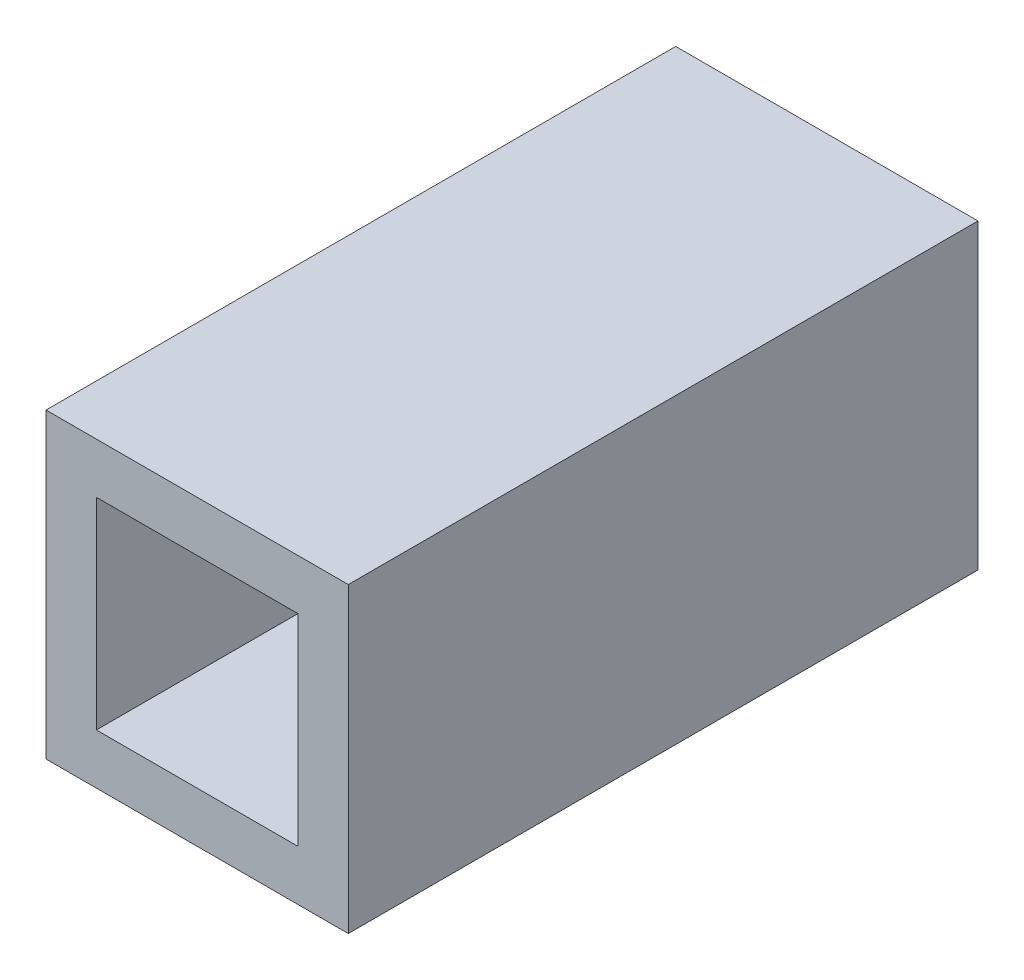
ISO-10303-21;
HEADER;
FILE_DESCRIPTION(('STEP AP214'),'2;1');
FILE_NAME('part.step','',(''),(''),'','','');
FILE_SCHEMA(('AUTOMOTIVE_DESIGN { 1 0 10303 214 1 1 1 1 }'));
ENDSEC;
DATA;
#1=APPLICATION_CONTEXT('core data for automotive mechanical design processes');
#2=APPLICATION_PROTOCOL_DEFINITION('international standard','automotive_design',2000,#1);
#3=PRODUCT_CONTEXT('',#1,'mechanical');
#4=PRODUCT('Part','Part','',(#3));
#5=PRODUCT_RELATED_PRODUCT_CATEGORY('part','',(#4));
#6=PRODUCT_DEFINITION_FORMATION('','',#4);
#7=PRODUCT_DEFINITION_CONTEXT('part definition',#1,'design');
#8=PRODUCT_DEFINITION('design','',#6,#7);
#9=PRODUCT_DEFINITION_SHAPE('','',#8);
#10=(LENGTH_UNIT() NAMED_UNIT(*) SI_UNIT(.MILLI.,.METRE.));
#11=(NAMED_UNIT(*) PLANE_ANGLE_UNIT() SI_UNIT($,.RADIAN.));
#12=(NAMED_UNIT(*) SI_UNIT($,.STERADIAN.) SOLID_ANGLE_UNIT());
#13=UNCERTAINTY_MEASURE_WITH_UNIT(LENGTH_MEASURE(1.E-05),#10,'distance_accuracy_value','');
#14=(GEOMETRIC_REPRESENTATION_CONTEXT(3) GLOBAL_UNCERTAINTY_ASSIGNED_CONTEXT((#13)) GLOBAL_UNIT_ASSIGNED_CONTEXT((#10,
#11,#12)) REPRESENTATION_CONTEXT('',''));
#15=CARTESIAN_POINT('',(0.,0.,0.));
#16=DIRECTION('',(0.,0.,1.));
#17=DIRECTION('',(1.,0.,0.));
#18=AXIS2_PLACEMENT_3D('',#15,#16,#17);
#19=CARTESIAN_POINT('',(-60.,60.,125.));
#20=DIRECTION('',(1.,0.,0.));
#21=DIRECTION('',(0.,1.,0.));
#22=AXIS2_PLACEMENT_3D('',#19,#20,#21);
#23=PLANE('',#22);
#24=DIRECTION('',(0.,0.,1.));
#25=VECTOR('',#24,1.);
#26=CARTESIAN_POINT('',(-60.,-10.,20.));
#27=LINE('',#26,#25);
#28=CARTESIAN_POINT('',(-60.,-10.,-20.));
#29=VERTEX_POINT('',#28);
#30=CARTESIAN_POINT('',(-60.,-10.,20.));
#31=VERTEX_POINT('',#30);
#32=EDGE_CURVE('E150',#29,#31,#27,.T.);
#33=ORIENTED_EDGE('',*,*,#32,.F.);
#34=DIRECTION('',(0.,-1.,0.));
#35=VECTOR('',#34,1.);
#36=CARTESIAN_POINT('',(-60.,9.99999999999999,-20.));
#37=LINE('',#36,#35);
#38=CARTESIAN_POINT('',(-60.,9.99999999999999,-20.));
#39=VERTEX_POINT('',#38);
#40=EDGE_CURVE('E47',#39,#29,#37,.T.);
#41=ORIENTED_EDGE('',*,*,#40,.F.);
#42=DIRECTION('',(0.,0.,-1.));
#43=VECTOR('',#42,1.);
#44=CARTESIAN_POINT('',(-60.,9.99999999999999,20.));
#45=LINE('',#44,#43);
#46=CARTESIAN_POINT('',(-60.,9.99999999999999,20.));
#47=VERTEX_POINT('',#46);
#48=EDGE_CURVE('E141',#47,#39,#45,.T.);
#49=ORIENTED_EDGE('',*,*,#48,.F.);
#50=DIRECTION('',(0.,1.,0.));
#51=VECTOR('',#50,1.);
#52=CARTESIAN_POINT('',(-60.,9.99999999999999,20.));
#53=LINE('',#52,#51);
#54=EDGE_CURVE('E144',#31,#47,#53,.T.);
#55=ORIENTED_EDGE('',*,*,#54,.F.);
#56=EDGE_LOOP('',(#33,#41,#49,#55));
#57=FACE_BOUND('',#56,.T.);
#58=DIRECTION('',(0.,-1.,0.));
#59=VECTOR('',#58,1.);
#60=CARTESIAN_POINT('',(-60.,60.,-125.));
#61=LINE('',#60,#59);
#62=CARTESIAN_POINT('',(-60.,60.,-125.));
#63=VERTEX_POINT('',#62);
#64=CARTESIAN_POINT('',(-60.,-60.,-125.));
#65=VERTEX_POINT('',#64);
#66=EDGE_CURVE('E183',#63,#65,#61,.T.);
#67=ORIENTED_EDGE('',*,*,#66,.T.);
#68=DIRECTION('',(0.,0.,-1.));
#69=VECTOR('',#68,1.);
#70=CARTESIAN_POINT('',(-60.,-60.,125.));
#71=LINE('',#70,#69);
#72=CARTESIAN_POINT('',(-60.,-60.,125.));
#73=VERTEX_POINT('',#72);
#74=EDGE_CURVE('E11',#73,#65,#71,.T.);
#75=ORIENTED_EDGE('',*,*,#74,.F.);
#76=DIRECTION('',(0.,-1.,0.));
#77=VECTOR('',#76,1.);
#78=CARTESIAN_POINT('',(-60.,60.,125.));
#79=LINE('',#78,#77);
#80=CARTESIAN_POINT('',(-60.,60.,125.));
#81=VERTEX_POINT('',#80);
#82=EDGE_CURVE('E190',#81,#73,#79,.T.);
#83=ORIENTED_EDGE('',*,*,#82,.F.);
#84=DIRECTION('',(0.,0.,-1.));
#85=VECTOR('',#84,1.);
#86=CARTESIAN_POINT('',(-60.,60.,125.));
#87=LINE('',#86,#85);
#88=EDGE_CURVE('E200',#81,#63,#87,.T.);
#89=ORIENTED_EDGE('',*,*,#88,.T.);
#90=EDGE_LOOP('',(#67,#75,#83,#89));
#91=FACE_BOUND('',#90,.T.);
#92=ADVANCED_FACE('F33',(#57,#91),#23,.F.);
#93=CARTESIAN_POINT('',(60.,-60.,125.));
#94=DIRECTION('',(0.,1.,0.));
#95=DIRECTION('',(-1.,0.,0.));
#96=AXIS2_PLACEMENT_3D('',#93,#94,#95);
#97=PLANE('',#96);
#98=DIRECTION('',(1.,0.,0.));
#99=VECTOR('',#98,1.);
#100=CARTESIAN_POINT('',(60.,-60.,-125.));
#101=LINE('',#100,#99);
#102=CARTESIAN_POINT('',(60.,-60.,-125.));
#103=VERTEX_POINT('',#102);
#104=EDGE_CURVE('E203',#65,#103,#101,.T.);
#105=ORIENTED_EDGE('',*,*,#104,.T.);
#106=DIRECTION('',(0.,0.,-1.));
#107=VECTOR('',#106,1.);
#108=CARTESIAN_POINT('',(60.,-60.,125.));
#109=LINE('',#108,#107);
#110=CARTESIAN_POINT('',(60.,-60.,125.));
#111=VERTEX_POINT('',#110);
#112=EDGE_CURVE('E40',#111,#103,#109,.T.);
#113=ORIENTED_EDGE('',*,*,#112,.F.);
#114=DIRECTION('',(1.,0.,0.));
#115=VECTOR('',#114,1.);
#116=CARTESIAN_POINT('',(60.,-60.,125.));
#117=LINE('',#116,#115);
#118=EDGE_CURVE('E193',#73,#111,#117,.T.);
#119=ORIENTED_EDGE('',*,*,#118,.F.);
#120=ORIENTED_EDGE('',*,*,#74,.T.);
#121=EDGE_LOOP('',(#105,#113,#119,#120));
#122=FACE_BOUND('',#121,.T.);
#123=ADVANCED_FACE('F233',(#122),#97,.F.);
#124=CARTESIAN_POINT('',(60.,60.,125.));
#125=DIRECTION('',(-1.,0.,0.));
#126=DIRECTION('',(0.,-1.,0.));
#127=AXIS2_PLACEMENT_3D('',#124,#125,#126);
#128=PLANE('',#127);
#129=DIRECTION('',(0.,1.,0.));
#130=VECTOR('',#129,1.);
#131=CARTESIAN_POINT('',(60.,60.,-125.));
#132=LINE('',#131,#130);
#133=CARTESIAN_POINT('',(60.,60.,-125.));
#134=VERTEX_POINT('',#133);
#135=EDGE_CURVE('E205',#103,#134,#132,.T.);
#136=ORIENTED_EDGE('',*,*,#135,.T.);
#137=DIRECTION('',(0.,0.,-1.));
#138=VECTOR('',#137,1.);
#139=CARTESIAN_POINT('',(60.,60.,125.));
#140=LINE('',#139,#138);
#141=CARTESIAN_POINT('',(60.,60.,125.));
#142=VERTEX_POINT('',#141);
#143=EDGE_CURVE('E210',#142,#134,#140,.T.);
#144=ORIENTED_EDGE('',*,*,#143,.F.);
#145=DIRECTION('',(0.,1.,0.));
#146=VECTOR('',#145,1.);
#147=CARTESIAN_POINT('',(60.,60.,125.));
#148=LINE('',#147,#146);
#149=EDGE_CURVE('E196',#111,#142,#148,.T.);
#150=ORIENTED_EDGE('',*,*,#149,.F.);
#151=ORIENTED_EDGE('',*,*,#112,.T.);
#152=EDGE_LOOP('',(#136,#144,#150,#151));
#153=FACE_BOUND('',#152,.T.);
#154=ADVANCED_FACE('F217',(#153),#128,.F.);
#155=CARTESIAN_POINT('',(60.,60.,125.));
#156=DIRECTION('',(0.,-1.,0.));
#157=DIRECTION('',(1.,0.,0.));
#158=AXIS2_PLACEMENT_3D('',#155,#156,#157);
#159=PLANE('',#158);
#160=DIRECTION('',(-1.,0.,0.));
#161=VECTOR('',#160,1.);
#162=CARTESIAN_POINT('',(60.,60.,-125.));
#163=LINE('',#162,#161);
#164=EDGE_CURVE('E194',#134,#63,#163,.T.);
#165=ORIENTED_EDGE('',*,*,#164,.T.);
#166=ORIENTED_EDGE('',*,*,#88,.F.);
#167=DIRECTION('',(-1.,0.,0.));
#168=VECTOR('',#167,1.);
#169=CARTESIAN_POINT('',(60.,60.,125.));
#170=LINE('',#169,#168);
#171=EDGE_CURVE('E198',#142,#81,#170,.T.);
#172=ORIENTED_EDGE('',*,*,#171,.F.);
#173=ORIENTED_EDGE('',*,*,#143,.T.);
#174=EDGE_LOOP('',(#165,#166,#172,#173));
#175=FACE_BOUND('',#174,.T.);
#176=ADVANCED_FACE('F226',(#175),#159,.F.);
#177=CARTESIAN_POINT('',(0.,0.,125.));
#178=DIRECTION('',(0.,0.,-1.));
#179=DIRECTION('',(-1.,0.,0.));
#180=AXIS2_PLACEMENT_3D('',#177,#178,#179);
#181=PLANE('',#180);
#182=DIRECTION('',(0.,-1.,0.));
#183=VECTOR('',#182,1.);
#184=CARTESIAN_POINT('',(40.,40.,125.));
#185=LINE('',#184,#183);
#186=CARTESIAN_POINT('',(40.,40.,125.));
#187=VERTEX_POINT('',#186);
#188=CARTESIAN_POINT('',(40.,-40.,125.));
#189=VERTEX_POINT('',#188);
#190=EDGE_CURVE('E168',#187,#189,#185,.T.);
#191=ORIENTED_EDGE('',*,*,#190,.T.);
#192=DIRECTION('',(-1.,0.,0.));
#193=VECTOR('',#192,1.);
#194=CARTESIAN_POINT('',(40.,-40.,125.));
#195=LINE('',#194,#193);
#196=CARTESIAN_POINT('',(-40.,-40.,125.));
#197=VERTEX_POINT('',#196);
#198=EDGE_CURVE('E160',#189,#197,#195,.T.);
#199=ORIENTED_EDGE('',*,*,#198,.T.);
#200=DIRECTION('',(0.,1.,0.));
#201=VECTOR('',#200,1.);
#202=CARTESIAN_POINT('',(-40.,-40.,125.));
#203=LINE('',#202,#201);
#204=CARTESIAN_POINT('',(-40.,40.,125.));
#205=VERTEX_POINT('',#204);
#206=EDGE_CURVE('E163',#197,#205,#203,.T.);
#207=ORIENTED_EDGE('',*,*,#206,.T.);
#208=DIRECTION('',(1.,0.,0.));
#209=VECTOR('',#208,1.);
#210=CARTESIAN_POINT('',(-40.,40.,125.));
#211=LINE('',#210,#209);
#212=EDGE_CURVE('E55',#205,#187,#211,.T.);
#213=ORIENTED_EDGE('',*,*,#212,.T.);
#214=EDGE_LOOP('',(#191,#199,#207,#213));
#215=FACE_BOUND('',#214,.T.);
#216=ORIENTED_EDGE('',*,*,#82,.T.);
#217=ORIENTED_EDGE('',*,*,#118,.T.);
#218=ORIENTED_EDGE('',*,*,#149,.T.);
#219=ORIENTED_EDGE('',*,*,#171,.T.);
#220=EDGE_LOOP('',(#216,#217,#218,#219));
#221=FACE_BOUND('',#220,.T.);
#222=ADVANCED_FACE('F232',(#215,#221),#181,.F.);
#223=CARTESIAN_POINT('',(0.,0.,-125.));
#224=DIRECTION('',(0.,0.,-1.));
#225=DIRECTION('',(-1.,0.,0.));
#226=AXIS2_PLACEMENT_3D('',#223,#224,#225);
#227=PLANE('',#226);
#228=DIRECTION('',(-1.,0.,0.));
#229=VECTOR('',#228,1.);
#230=CARTESIAN_POINT('',(40.,-40.,-125.));
#231=LINE('',#230,#229);
#232=CARTESIAN_POINT('',(40.,-40.,-125.));
#233=VERTEX_POINT('',#232);
#234=CARTESIAN_POINT('',(-40.,-40.,-125.));
#235=VERTEX_POINT('',#234);
#236=EDGE_CURVE('E156',#233,#235,#231,.T.);
#237=ORIENTED_EDGE('',*,*,#236,.F.);
#238=DIRECTION('',(0.,-1.,0.));
#239=VECTOR('',#238,1.);
#240=CARTESIAN_POINT('',(40.,40.,-125.));
#241=LINE('',#240,#239);
#242=CARTESIAN_POINT('',(40.,40.,-125.));
#243=VERTEX_POINT('',#242);
#244=EDGE_CURVE('E164',#243,#233,#241,.T.);
#245=ORIENTED_EDGE('',*,*,#244,.F.);
#246=DIRECTION('',(1.,0.,0.));
#247=VECTOR('',#246,1.);
#248=CARTESIAN_POINT('',(-40.,40.,-125.));
#249=LINE('',#248,#247);
#250=CARTESIAN_POINT('',(-40.,40.,-125.));
#251=VERTEX_POINT('',#250);
#252=EDGE_CURVE('E176',#251,#243,#249,.T.);
#253=ORIENTED_EDGE('',*,*,#252,.F.);
#254=DIRECTION('',(0.,1.,0.));
#255=VECTOR('',#254,1.);
#256=CARTESIAN_POINT('',(-40.,-40.,-125.));
#257=LINE('',#256,#255);
#258=EDGE_CURVE('E173',#235,#251,#257,.T.);
#259=ORIENTED_EDGE('',*,*,#258,.F.);
#260=EDGE_LOOP('',(#237,#245,#253,#259));
#261=FACE_BOUND('',#260,.T.);
#262=ORIENTED_EDGE('',*,*,#66,.F.);
#263=ORIENTED_EDGE('',*,*,#164,.F.);
#264=ORIENTED_EDGE('',*,*,#135,.F.);
#265=ORIENTED_EDGE('',*,*,#104,.F.);
#266=EDGE_LOOP('',(#262,#263,#264,#265));
#267=FACE_BOUND('',#266,.T.);
#268=ADVANCED_FACE('F223',(#261,#267),#227,.T.);
#269=CARTESIAN_POINT('',(40.,-40.,125.));
#270=DIRECTION('',(0.,-1.,0.));
#271=DIRECTION('',(1.,0.,0.));
#272=AXIS2_PLACEMENT_3D('',#269,#270,#271);
#273=PLANE('',#272);
#274=ORIENTED_EDGE('',*,*,#236,.T.);
#275=DIRECTION('',(0.,0.,-1.));
#276=VECTOR('',#275,1.);
#277=CARTESIAN_POINT('',(-40.,-40.,125.));
#278=LINE('',#277,#276);
#279=EDGE_CURVE('E171',#197,#235,#278,.T.);
#280=ORIENTED_EDGE('',*,*,#279,.F.);
#281=ORIENTED_EDGE('',*,*,#198,.F.);
#282=DIRECTION('',(0.,0.,-1.));
#283=VECTOR('',#282,1.);
#284=CARTESIAN_POINT('',(40.,-40.,125.));
#285=LINE('',#284,#283);
#286=EDGE_CURVE('E181',#189,#233,#285,.T.);
#287=ORIENTED_EDGE('',*,*,#286,.T.);
#288=EDGE_LOOP('',(#274,#280,#281,#287));
#289=FACE_BOUND('',#288,.T.);
#290=ADVANCED_FACE('F246',(#289),#273,.F.);
#291=CARTESIAN_POINT('',(40.,40.,125.));
#292=DIRECTION('',(1.,0.,0.));
#293=DIRECTION('',(0.,1.,0.));
#294=AXIS2_PLACEMENT_3D('',#291,#292,#293);
#295=PLANE('',#294);
#296=ORIENTED_EDGE('',*,*,#244,.T.);
#297=ORIENTED_EDGE('',*,*,#286,.F.);
#298=ORIENTED_EDGE('',*,*,#190,.F.);
#299=DIRECTION('',(0.,0.,-1.));
#300=VECTOR('',#299,1.);
#301=CARTESIAN_POINT('',(40.,40.,125.));
#302=LINE('',#301,#300);
#303=EDGE_CURVE('E184',#187,#243,#302,.T.);
#304=ORIENTED_EDGE('',*,*,#303,.T.);
#305=EDGE_LOOP('',(#296,#297,#298,#304));
#306=FACE_BOUND('',#305,.T.);
#307=ADVANCED_FACE('F253',(#306),#295,.F.);
#308=CARTESIAN_POINT('',(-40.,40.,125.));
#309=DIRECTION('',(0.,1.,0.));
#310=DIRECTION('',(-1.,0.,0.));
#311=AXIS2_PLACEMENT_3D('',#308,#309,#310);
#312=PLANE('',#311);
#313=ORIENTED_EDGE('',*,*,#252,.T.);
#314=ORIENTED_EDGE('',*,*,#303,.F.);
#315=ORIENTED_EDGE('',*,*,#212,.F.);
#316=DIRECTION('',(0.,0.,-1.));
#317=VECTOR('',#316,1.);
#318=CARTESIAN_POINT('',(-40.,40.,125.));
#319=LINE('',#318,#317);
#320=EDGE_CURVE('E186',#205,#251,#319,.T.);
#321=ORIENTED_EDGE('',*,*,#320,.T.);
#322=EDGE_LOOP('',(#313,#314,#315,#321));
#323=FACE_BOUND('',#322,.T.);
#324=ADVANCED_FACE('F258',(#323),#312,.F.);
#325=CARTESIAN_POINT('',(-40.,-40.,125.));
#326=DIRECTION('',(-1.,0.,0.));
#327=DIRECTION('',(0.,-1.,0.));
#328=AXIS2_PLACEMENT_3D('',#325,#326,#327);
#329=PLANE('',#328);
#330=ORIENTED_EDGE('',*,*,#258,.T.);
#331=ORIENTED_EDGE('',*,*,#320,.F.);
#332=ORIENTED_EDGE('',*,*,#206,.F.);
#333=ORIENTED_EDGE('',*,*,#279,.T.);
#334=EDGE_LOOP('',(#330,#331,#332,#333));
#335=FACE_BOUND('',#334,.T.);
#336=ADVANCED_FACE('F255',(#335),#329,.F.);
#337=CARTESIAN_POINT('',(-50.,9.99999999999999,-20.));
#338=DIRECTION('',(0.,0.,-1.));
#339=DIRECTION('',(-1.,0.,0.));
#340=AXIS2_PLACEMENT_3D('',#337,#338,#339);
#341=PLANE('',#340);
#342=ORIENTED_EDGE('',*,*,#40,.T.);
#343=DIRECTION('',(-1.,0.,0.));
#344=VECTOR('',#343,1.);
#345=CARTESIAN_POINT('',(-50.,-10.,-20.));
#346=LINE('',#345,#344);
#347=CARTESIAN_POINT('',(-50.,-10.,-20.));
#348=VERTEX_POINT('',#347);
#349=EDGE_CURVE('E119',#348,#29,#346,.T.);
#350=ORIENTED_EDGE('',*,*,#349,.F.);
#351=DIRECTION('',(0.,-1.,0.));
#352=VECTOR('',#351,1.);
#353=CARTESIAN_POINT('',(-50.,9.99999999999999,-20.));
#354=LINE('',#353,#352);
#355=CARTESIAN_POINT('',(-50.,9.99999999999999,-20.));
#356=VERTEX_POINT('',#355);
#357=EDGE_CURVE('E123',#356,#348,#354,.T.);
#358=ORIENTED_EDGE('',*,*,#357,.F.);
#359=DIRECTION('',(-1.,0.,0.));
#360=VECTOR('',#359,1.);
#361=CARTESIAN_POINT('',(-50.,9.99999999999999,-20.));
#362=LINE('',#361,#360);
#363=EDGE_CURVE('E154',#356,#39,#362,.T.);
#364=ORIENTED_EDGE('',*,*,#363,.T.);
#365=EDGE_LOOP('',(#342,#350,#358,#364));
#366=FACE_BOUND('',#365,.T.);
#367=ADVANCED_FACE('F121',(#366),#341,.F.);
#368=CARTESIAN_POINT('',(-50.,9.99999999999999,20.));
#369=DIRECTION('',(0.,1.,0.));
#370=DIRECTION('',(-1.,0.,0.));
#371=AXIS2_PLACEMENT_3D('',#368,#369,#370);
#372=PLANE('',#371);
#373=ORIENTED_EDGE('',*,*,#48,.T.);
#374=ORIENTED_EDGE('',*,*,#363,.F.);
#375=DIRECTION('',(0.,0.,-1.));
#376=VECTOR('',#375,1.);
#377=CARTESIAN_POINT('',(-50.,9.99999999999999,20.));
#378=LINE('',#377,#376);
#379=CARTESIAN_POINT('',(-50.,9.99999999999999,20.));
#380=VERTEX_POINT('',#379);
#381=EDGE_CURVE('E129',#380,#356,#378,.T.);
#382=ORIENTED_EDGE('',*,*,#381,.F.);
#383=DIRECTION('',(-1.,0.,0.));
#384=VECTOR('',#383,1.);
#385=CARTESIAN_POINT('',(-50.,9.99999999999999,20.));
#386=LINE('',#385,#384);
#387=EDGE_CURVE('E157',#380,#47,#386,.T.);
#388=ORIENTED_EDGE('',*,*,#387,.T.);
#389=EDGE_LOOP('',(#373,#374,#382,#388));
#390=FACE_BOUND('',#389,.T.);
#391=ADVANCED_FACE('F267',(#390),#372,.F.);
#392=CARTESIAN_POINT('',(-50.,9.99999999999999,20.));
#393=DIRECTION('',(0.,0.,1.));
#394=DIRECTION('',(1.,0.,0.));
#395=AXIS2_PLACEMENT_3D('',#392,#393,#394);
#396=PLANE('',#395);
#397=ORIENTED_EDGE('',*,*,#54,.T.);
#398=ORIENTED_EDGE('',*,*,#387,.F.);
#399=DIRECTION('',(0.,1.,0.));
#400=VECTOR('',#399,1.);
#401=CARTESIAN_POINT('',(-50.,9.99999999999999,20.));
#402=LINE('',#401,#400);
#403=CARTESIAN_POINT('',(-50.,-10.,20.));
#404=VERTEX_POINT('',#403);
#405=EDGE_CURVE('E137',#404,#380,#402,.T.);
#406=ORIENTED_EDGE('',*,*,#405,.F.);
#407=DIRECTION('',(-1.,0.,0.));
#408=VECTOR('',#407,1.);
#409=CARTESIAN_POINT('',(-50.,-10.,20.));
#410=LINE('',#409,#408);
#411=EDGE_CURVE('E128',#404,#31,#410,.T.);
#412=ORIENTED_EDGE('',*,*,#411,.T.);
#413=EDGE_LOOP('',(#397,#398,#406,#412));
#414=FACE_BOUND('',#413,.T.);
#415=ADVANCED_FACE('F270',(#414),#396,.F.);
#416=CARTESIAN_POINT('',(-50.,-10.,20.));
#417=DIRECTION('',(0.,-1.,0.));
#418=DIRECTION('',(1.,0.,0.));
#419=AXIS2_PLACEMENT_3D('',#416,#417,#418);
#420=PLANE('',#419);
#421=ORIENTED_EDGE('',*,*,#32,.T.);
#422=ORIENTED_EDGE('',*,*,#411,.F.);
#423=DIRECTION('',(0.,0.,1.));
#424=VECTOR('',#423,1.);
#425=CARTESIAN_POINT('',(-50.,-10.,20.));
#426=LINE('',#425,#424);
#427=EDGE_CURVE('E132',#348,#404,#426,.T.);
#428=ORIENTED_EDGE('',*,*,#427,.F.);
#429=ORIENTED_EDGE('',*,*,#349,.T.);
#430=EDGE_LOOP('',(#421,#422,#428,#429));
#431=FACE_BOUND('',#430,.T.);
#432=ADVANCED_FACE('F133',(#431),#420,.F.);
#433=CARTESIAN_POINT('',(-50.,0.,0.));
#434=DIRECTION('',(1.,0.,0.));
#435=DIRECTION('',(0.,0.,-1.));
#436=AXIS2_PLACEMENT_3D('',#433,#434,#435);
#437=PLANE('',#436);
#438=ORIENTED_EDGE('',*,*,#357,.T.);
#439=ORIENTED_EDGE('',*,*,#427,.T.);
#440=ORIENTED_EDGE('',*,*,#405,.T.);
#441=ORIENTED_EDGE('',*,*,#381,.T.);
#442=EDGE_LOOP('',(#438,#439,#440,#441));
#443=FACE_BOUND('',#442,.T.);
#444=ADVANCED_FACE('F139',(#443),#437,.F.);
#445=CLOSED_SHELL('',(#92,#123,#154,#176,#222,#268,#290,#307,#324,#336,#367,#391,#415,#432,#444));
#446=MANIFOLD_SOLID_BREP('B2',#445);
#447=ADVANCED_BREP_SHAPE_REPRESENTATION('',(#18,#446),#14);
#448=SHAPE_DEFINITION_REPRESENTATION(#9,#447);
ENDSEC;
END-ISO-10303-21;
